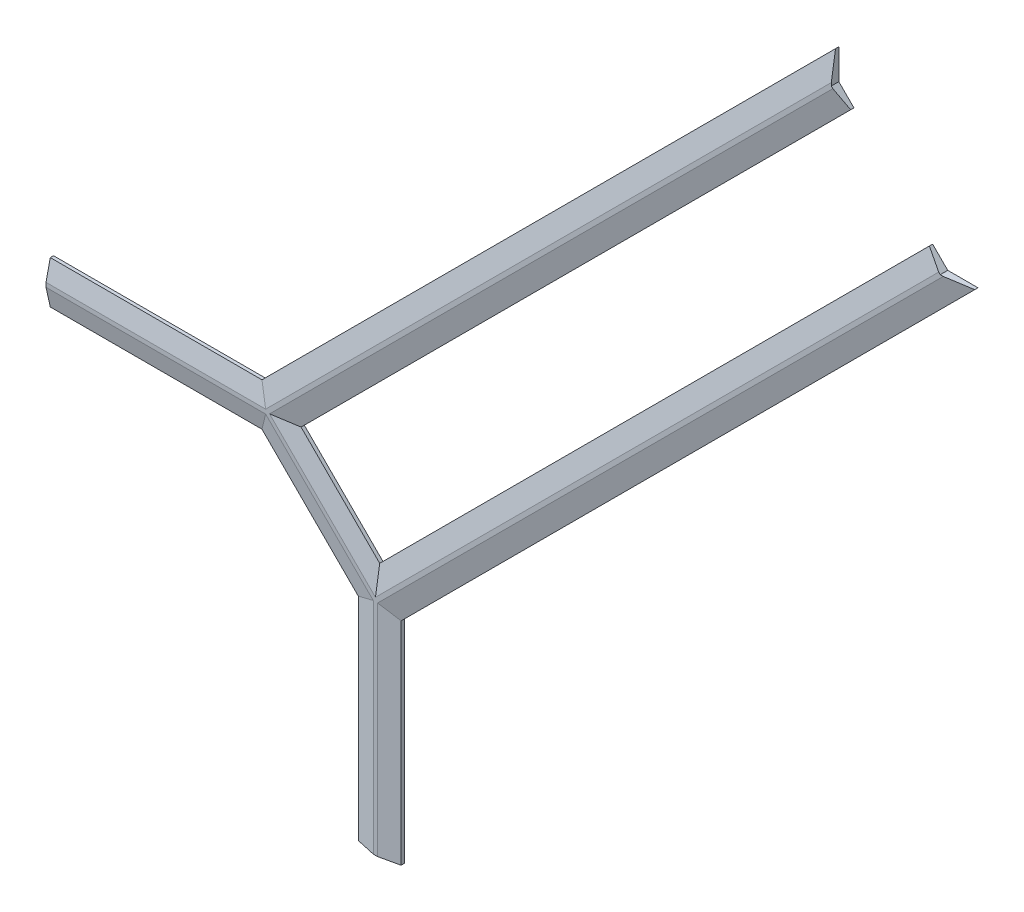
from build123d import *
from OCP.BRepFilletAPI import BRepFilletAPI_MakeChamfer

# Parameters (mm, degrees)
EXTRUDE1_DEPTH = 22.352
CHAMFER1_SIZE  = 12.7
CHAMFER1_SIZE2 = 57.15


with BuildPart() as part:
    # Sketch1 → Extrude1 (new body)
    with BuildSketch(Plane.XY):
        Polygon((-779.586659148, -546.1), (807.010779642, 1040.497438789), (851.912060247, 1085.398719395), (807.010779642, 1130.3), (807.010779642, 1220.102561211), (-895.691781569, -482.6), (-1524, -482.6), (-1524, -609.6), (-895.691781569, -609.6), (-609.6, -895.691781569), (-609.6, -1524), (-482.6, -1524), (-482.6, -895.691781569), (1220.102561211, 807.010779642), (1130.3, 807.010779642), (1085.398719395, 851.912060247), (1040.497438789, 807.010779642), (-546.1, -779.586659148), align=None)
    extrude(amount=EXTRUDE1_DEPTH)

    # Chamfer1: one chamfer whose edges measure the first distance from different faces: ONE call of the kernel's chamfer builder (chamfer() names one face for all edges)
    chamfer1_edges_1 = [part.edges().sort_by_distance(p)[0] for p in [
        (-1209.845890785, -482.6, 22.352),
    ]]
    chamfer1_side_1 = [part.faces().sort_by_distance(p)[0] for p in [
        (-1209.845890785, -482.6, 11.176),
    ]]
    chamfer1_edges_2 = [part.edges().sort_by_distance(p)[0] for p in [
        (-1209.845890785, -609.6, 22.352),
    ]]
    chamfer1_side_2 = [part.faces().sort_by_distance(p)[0] for p in [
        (-1209.845890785, -609.6, 11.176),
    ]]
    chamfer1_edges_3 = [part.edges().sort_by_distance(p)[0] for p in [
        (-752.645890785, -752.645890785, 22.352),
    ]]
    chamfer1_side_3 = [part.faces().sort_by_distance(p)[0] for p in [
        (-752.645890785, -752.645890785, 11.176),
    ]]
    chamfer1_edges_4 = [part.edges().sort_by_distance(p)[0] for p in [
        (-609.6, -1209.845890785, 22.352),
    ]]
    chamfer1_side_4 = [part.faces().sort_by_distance(p)[0] for p in [
        (-609.6, -1209.845890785, 11.176),
    ]]
    chamfer1_edges_5 = [part.edges().sort_by_distance(p)[0] for p in [
        (-482.6, -1209.845890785, 22.352),
    ]]
    chamfer1_side_5 = [part.faces().sort_by_distance(p)[0] for p in [
        (-482.6, -1209.845890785, 11.176),
    ]]
    chamfer1_edges_6 = [part.edges().sort_by_distance(p)[0] for p in [
        (368.751280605, -44.340500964, 22.352),
    ]]
    chamfer1_side_6 = [part.faces().sort_by_distance(p)[0] for p in [
        (368.751280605, -44.340500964, 11.176),
    ]]
    chamfer1_edges_7 = [part.edges().sort_by_distance(p)[0] for p in [
        (269.649359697, 36.16270055, 22.352),
    ]]
    chamfer1_side_7 = [part.faces().sort_by_distance(p)[0] for p in [
        (269.649359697, 36.16270055, 11.176),
    ]]
    chamfer1_edges_8 = [part.edges().sort_by_distance(p)[0] for p in [
        (-662.843329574, -662.843329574, 22.352),
    ]]
    chamfer1_side_8 = [part.faces().sort_by_distance(p)[0] for p in [
        (-662.843329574, -662.843329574, 11.176),
    ]]
    chamfer1_edges_9 = [part.edges().sort_by_distance(p)[0] for p in [
        (36.16270055, 269.649359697, 22.352),
    ]]
    chamfer1_side_9 = [part.faces().sort_by_distance(p)[0] for p in [
        (36.16270055, 269.649359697, 11.176),
    ]]
    chamfer1_edges_10 = [part.edges().sort_by_distance(p)[0] for p in [
        (-44.340500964, 368.751280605, 22.352),
    ]]
    chamfer1_side_10 = [part.faces().sort_by_distance(p)[0] for p in [
        (-44.340500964, 368.751280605, 11.176),
    ]]
    chamfer1 = BRepFilletAPI_MakeChamfer(part.part.solid().wrapped)
    for e in chamfer1_edges_1:
        chamfer1.Add(CHAMFER1_SIZE, CHAMFER1_SIZE2, e.wrapped, chamfer1_side_1[0].wrapped)  # the first distance lies on this face
    for e in chamfer1_edges_2:
        chamfer1.Add(CHAMFER1_SIZE, CHAMFER1_SIZE2, e.wrapped, chamfer1_side_2[0].wrapped)  # the first distance lies on this face
    for e in chamfer1_edges_3:
        chamfer1.Add(CHAMFER1_SIZE, CHAMFER1_SIZE2, e.wrapped, chamfer1_side_3[0].wrapped)  # the first distance lies on this face
    for e in chamfer1_edges_4:
        chamfer1.Add(CHAMFER1_SIZE, CHAMFER1_SIZE2, e.wrapped, chamfer1_side_4[0].wrapped)  # the first distance lies on this face
    for e in chamfer1_edges_5:
        chamfer1.Add(CHAMFER1_SIZE, CHAMFER1_SIZE2, e.wrapped, chamfer1_side_5[0].wrapped)  # the first distance lies on this face
    for e in chamfer1_edges_6:
        chamfer1.Add(CHAMFER1_SIZE, CHAMFER1_SIZE2, e.wrapped, chamfer1_side_6[0].wrapped)  # the first distance lies on this face
    for e in chamfer1_edges_7:
        chamfer1.Add(CHAMFER1_SIZE, CHAMFER1_SIZE2, e.wrapped, chamfer1_side_7[0].wrapped)  # the first distance lies on this face
    for e in chamfer1_edges_8:
        chamfer1.Add(CHAMFER1_SIZE, CHAMFER1_SIZE2, e.wrapped, chamfer1_side_8[0].wrapped)  # the first distance lies on this face
    for e in chamfer1_edges_9:
        chamfer1.Add(CHAMFER1_SIZE, CHAMFER1_SIZE2, e.wrapped, chamfer1_side_9[0].wrapped)  # the first distance lies on this face
    for e in chamfer1_edges_10:
        chamfer1.Add(CHAMFER1_SIZE, CHAMFER1_SIZE2, e.wrapped, chamfer1_side_10[0].wrapped)  # the first distance lies on this face
    add(Compound.cast(chamfer1.Shape()), mode=Mode.REPLACE)


solid = part.part
